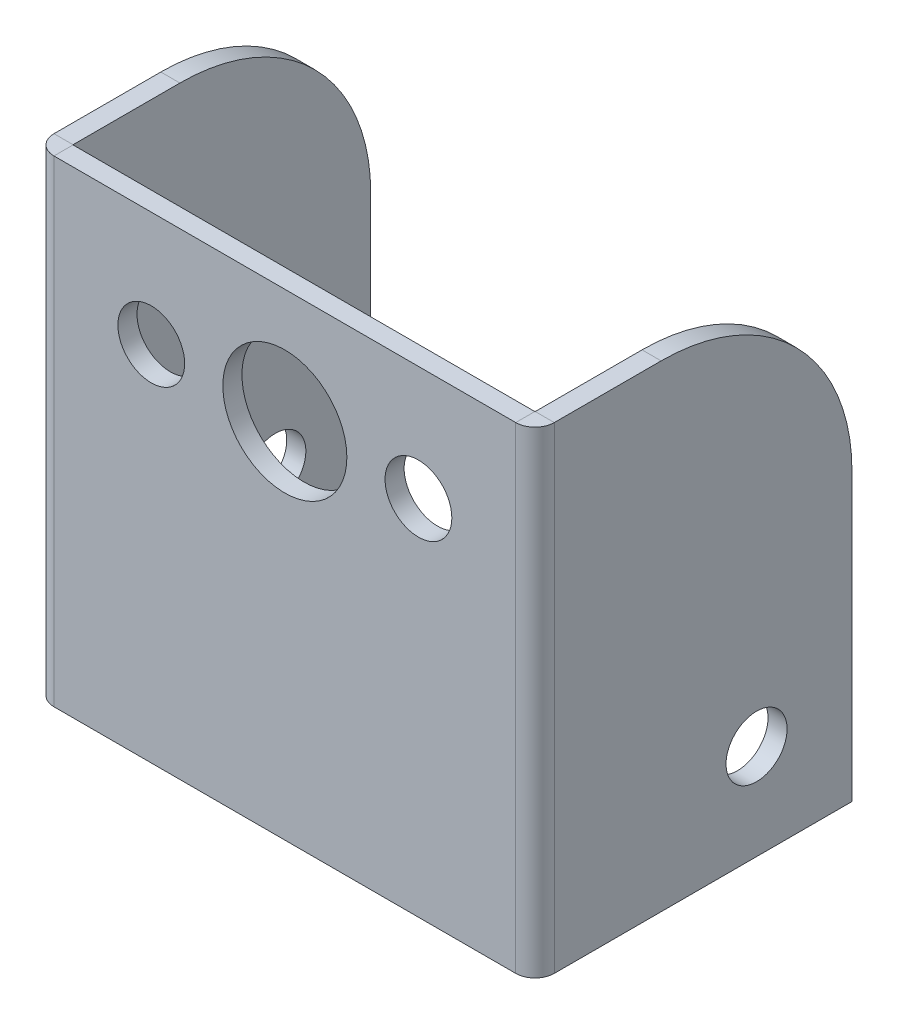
ISO-10303-21;
HEADER;
FILE_DESCRIPTION(('STEP AP214'),'2;1');
FILE_NAME('part.step','',(''),(''),'','','');
FILE_SCHEMA(('AUTOMOTIVE_DESIGN { 1 0 10303 214 1 1 1 1 }'));
ENDSEC;
DATA;
#1=APPLICATION_CONTEXT('core data for automotive mechanical design processes');
#2=APPLICATION_PROTOCOL_DEFINITION('international standard','automotive_design',2000,#1);
#3=PRODUCT_CONTEXT('',#1,'mechanical');
#4=PRODUCT('Part','Part','',(#3));
#5=PRODUCT_RELATED_PRODUCT_CATEGORY('part','',(#4));
#6=PRODUCT_DEFINITION_FORMATION('','',#4);
#7=PRODUCT_DEFINITION_CONTEXT('part definition',#1,'design');
#8=PRODUCT_DEFINITION('design','',#6,#7);
#9=PRODUCT_DEFINITION_SHAPE('','',#8);
#10=(LENGTH_UNIT() NAMED_UNIT(*) SI_UNIT(.MILLI.,.METRE.));
#11=(NAMED_UNIT(*) PLANE_ANGLE_UNIT() SI_UNIT($,.RADIAN.));
#12=(NAMED_UNIT(*) SI_UNIT($,.STERADIAN.) SOLID_ANGLE_UNIT());
#13=UNCERTAINTY_MEASURE_WITH_UNIT(LENGTH_MEASURE(1.E-05),#10,'distance_accuracy_value','');
#14=(GEOMETRIC_REPRESENTATION_CONTEXT(3) GLOBAL_UNCERTAINTY_ASSIGNED_CONTEXT((#13)) GLOBAL_UNIT_ASSIGNED_CONTEXT((#10,
#11,#12)) REPRESENTATION_CONTEXT('',''));
#15=CARTESIAN_POINT('',(0.,0.,0.));
#16=DIRECTION('',(0.,0.,1.));
#17=DIRECTION('',(1.,0.,0.));
#18=AXIS2_PLACEMENT_3D('',#15,#16,#17);
#19=CARTESIAN_POINT('',(0.,25.,1.));
#20=DIRECTION('',(0.,-1.,0.));
#21=DIRECTION('',(0.,0.,-1.));
#22=AXIS2_PLACEMENT_3D('',#19,#20,#21);
#23=PLANE('',#22);
#24=DIRECTION('',(-1.,0.,0.));
#25=VECTOR('',#24,1.);
#26=CARTESIAN_POINT('',(0.,25.,0.));
#27=LINE('',#26,#25);
#28=CARTESIAN_POINT('',(40.5994469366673,25.,0.));
#29=VERTEX_POINT('',#28);
#30=CARTESIAN_POINT('',(16.4005530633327,25.,-1.14802731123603E-08));
#31=VERTEX_POINT('',#30);
#32=EDGE_CURVE('E290',#29,#31,#27,.T.);
#33=ORIENTED_EDGE('',*,*,#32,.T.);
#34=DIRECTION('',(0.,0.,1.));
#35=VECTOR('',#34,1.);
#36=CARTESIAN_POINT('',(16.4005530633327,25.,1.));
#37=LINE('',#36,#35);
#38=CARTESIAN_POINT('',(16.4005530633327,25.,0.999999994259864));
#39=VERTEX_POINT('',#38);
#40=EDGE_CURVE('E280',#31,#39,#37,.T.);
#41=ORIENTED_EDGE('',*,*,#40,.T.);
#42=DIRECTION('',(-1.,0.,0.));
#43=VECTOR('',#42,1.);
#44=CARTESIAN_POINT('',(0.,25.,1.));
#45=LINE('',#44,#43);
#46=CARTESIAN_POINT('',(40.5994469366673,25.,1.00000001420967));
#47=VERTEX_POINT('',#46);
#48=EDGE_CURVE('E268',#47,#39,#45,.T.);
#49=ORIENTED_EDGE('',*,*,#48,.F.);
#50=DIRECTION('',(0.,0.,1.));
#51=VECTOR('',#50,1.);
#52=CARTESIAN_POINT('',(40.5994469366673,25.,1.));
#53=LINE('',#52,#51);
#54=EDGE_CURVE('E274',#29,#47,#53,.T.);
#55=ORIENTED_EDGE('',*,*,#54,.F.);
#56=EDGE_LOOP('',(#33,#41,#49,#55));
#57=FACE_BOUND('',#56,.T.);
#58=ADVANCED_FACE('F40',(#57),#23,.F.);
#59=CARTESIAN_POINT('',(0.,0.,1.));
#60=DIRECTION('',(0.,1.,0.));
#61=DIRECTION('',(0.,0.,1.));
#62=AXIS2_PLACEMENT_3D('',#59,#60,#61);
#63=PLANE('',#62);
#64=DIRECTION('',(1.,0.,0.));
#65=VECTOR('',#64,1.);
#66=CARTESIAN_POINT('',(0.,0.,1.));
#67=LINE('',#66,#65);
#68=CARTESIAN_POINT('',(16.4005530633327,0.,0.999999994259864));
#69=VERTEX_POINT('',#68);
#70=CARTESIAN_POINT('',(40.5994469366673,0.,1.));
#71=VERTEX_POINT('',#70);
#72=EDGE_CURVE('E293',#69,#71,#67,.T.);
#73=ORIENTED_EDGE('',*,*,#72,.F.);
#74=DIRECTION('',(0.,0.,-1.));
#75=VECTOR('',#74,1.);
#76=CARTESIAN_POINT('',(16.4005530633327,0.,1.));
#77=LINE('',#76,#75);
#78=CARTESIAN_POINT('',(16.4005530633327,0.,0.));
#79=VERTEX_POINT('',#78);
#80=EDGE_CURVE('E285',#69,#79,#77,.T.);
#81=ORIENTED_EDGE('',*,*,#80,.T.);
#82=DIRECTION('',(1.,0.,0.));
#83=VECTOR('',#82,1.);
#84=CARTESIAN_POINT('',(0.,0.,0.));
#85=LINE('',#84,#83);
#86=CARTESIAN_POINT('',(40.5994469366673,0.,0.));
#87=VERTEX_POINT('',#86);
#88=EDGE_CURVE('E263',#79,#87,#85,.T.);
#89=ORIENTED_EDGE('',*,*,#88,.T.);
#90=DIRECTION('',(0.,0.,-1.));
#91=VECTOR('',#90,1.);
#92=CARTESIAN_POINT('',(40.5994469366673,0.,1.));
#93=LINE('',#92,#91);
#94=EDGE_CURVE('E267',#71,#87,#93,.T.);
#95=ORIENTED_EDGE('',*,*,#94,.F.);
#96=EDGE_LOOP('',(#73,#81,#89,#95));
#97=FACE_BOUND('',#96,.T.);
#98=ADVANCED_FACE('F42',(#97),#63,.F.);
#99=CARTESIAN_POINT('',(0.,25.,1.));
#100=DIRECTION('',(0.,0.,-1.));
#101=DIRECTION('',(-1.,0.,0.));
#102=AXIS2_PLACEMENT_3D('',#99,#100,#101);
#103=PLANE('',#102);
#104=CARTESIAN_POINT('',(35.5,19.,1.));
#105=DIRECTION('',(0.,0.,1.));
#106=DIRECTION('',(1.,0.,0.));
#107=AXIS2_PLACEMENT_3D('',#104,#105,#106);
#108=CIRCLE('',#107,1.75);
#109=CARTESIAN_POINT('',(37.25,19.,1.));
#110=VERTEX_POINT('',#109);
#111=EDGE_CURVE('E248',#110,#110,#108,.T.);
#112=ORIENTED_EDGE('',*,*,#111,.F.);
#113=EDGE_LOOP('',(#112));
#114=FACE_BOUND('',#113,.T.);
#115=CARTESIAN_POINT('',(28.5,19.,1.));
#116=DIRECTION('',(0.,0.,1.));
#117=DIRECTION('',(1.,0.,0.));
#118=AXIS2_PLACEMENT_3D('',#115,#116,#117);
#119=CIRCLE('',#118,3.25);
#120=CARTESIAN_POINT('',(31.75,19.,1.));
#121=VERTEX_POINT('',#120);
#122=EDGE_CURVE('E260',#121,#121,#119,.T.);
#123=ORIENTED_EDGE('',*,*,#122,.F.);
#124=EDGE_LOOP('',(#123));
#125=FACE_BOUND('',#124,.T.);
#126=CARTESIAN_POINT('',(21.5,19.,1.));
#127=DIRECTION('',(0.,0.,1.));
#128=DIRECTION('',(1.,0.,0.));
#129=AXIS2_PLACEMENT_3D('',#126,#127,#128);
#130=CIRCLE('',#129,1.75);
#131=CARTESIAN_POINT('',(23.25,19.,1.));
#132=VERTEX_POINT('',#131);
#133=EDGE_CURVE('E254',#132,#132,#130,.T.);
#134=ORIENTED_EDGE('',*,*,#133,.F.);
#135=EDGE_LOOP('',(#134));
#136=FACE_BOUND('',#135,.T.);
#137=ORIENTED_EDGE('',*,*,#48,.T.);
#138=DIRECTION('',(0.,-1.,0.));
#139=VECTOR('',#138,1.);
#140=CARTESIAN_POINT('',(16.4005530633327,25.,1.));
#141=LINE('',#140,#139);
#142=EDGE_CURVE('E277',#39,#69,#141,.T.);
#143=ORIENTED_EDGE('',*,*,#142,.T.);
#144=ORIENTED_EDGE('',*,*,#72,.T.);
#145=DIRECTION('',(0.,-1.,0.));
#146=VECTOR('',#145,1.);
#147=CARTESIAN_POINT('',(40.5994469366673,25.,1.));
#148=LINE('',#147,#146);
#149=EDGE_CURVE('E264',#47,#71,#148,.T.);
#150=ORIENTED_EDGE('',*,*,#149,.F.);
#151=EDGE_LOOP('',(#137,#143,#144,#150));
#152=FACE_BOUND('',#151,.T.);
#153=ADVANCED_FACE('F332',(#114,#125,#136,#152),#103,.F.);
#154=CARTESIAN_POINT('',(0.,25.,0.));
#155=DIRECTION('',(0.,0.,-1.));
#156=DIRECTION('',(-1.,0.,0.));
#157=AXIS2_PLACEMENT_3D('',#154,#155,#156);
#158=PLANE('',#157);
#159=DIRECTION('',(0.,-1.,0.));
#160=VECTOR('',#159,1.);
#161=CARTESIAN_POINT('',(16.4005530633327,25.,0.));
#162=LINE('',#161,#160);
#163=EDGE_CURVE('E283',#31,#79,#162,.T.);
#164=ORIENTED_EDGE('',*,*,#163,.F.);
#165=ORIENTED_EDGE('',*,*,#32,.F.);
#166=DIRECTION('',(0.,-1.,0.));
#167=VECTOR('',#166,1.);
#168=CARTESIAN_POINT('',(40.5994469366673,25.,0.));
#169=LINE('',#168,#167);
#170=EDGE_CURVE('E271',#29,#87,#169,.T.);
#171=ORIENTED_EDGE('',*,*,#170,.T.);
#172=ORIENTED_EDGE('',*,*,#88,.F.);
#173=EDGE_LOOP('',(#164,#165,#171,#172));
#174=FACE_BOUND('',#173,.T.);
#175=CARTESIAN_POINT('',(21.5,19.,0.));
#176=DIRECTION('',(0.,0.,1.));
#177=DIRECTION('',(1.,0.,0.));
#178=AXIS2_PLACEMENT_3D('',#175,#176,#177);
#179=CIRCLE('',#178,1.75);
#180=CARTESIAN_POINT('',(23.25,19.,0.));
#181=VERTEX_POINT('',#180);
#182=EDGE_CURVE('E251',#181,#181,#179,.T.);
#183=ORIENTED_EDGE('',*,*,#182,.T.);
#184=EDGE_LOOP('',(#183));
#185=FACE_BOUND('',#184,.T.);
#186=CARTESIAN_POINT('',(28.5,19.,0.));
#187=DIRECTION('',(0.,0.,1.));
#188=DIRECTION('',(1.,0.,0.));
#189=AXIS2_PLACEMENT_3D('',#186,#187,#188);
#190=CIRCLE('',#189,3.25);
#191=CARTESIAN_POINT('',(31.75,19.,0.));
#192=VERTEX_POINT('',#191);
#193=EDGE_CURVE('E257',#192,#192,#190,.T.);
#194=ORIENTED_EDGE('',*,*,#193,.T.);
#195=EDGE_LOOP('',(#194));
#196=FACE_BOUND('',#195,.T.);
#197=CARTESIAN_POINT('',(35.5,19.,0.));
#198=DIRECTION('',(0.,0.,1.));
#199=DIRECTION('',(1.,0.,0.));
#200=AXIS2_PLACEMENT_3D('',#197,#198,#199);
#201=CIRCLE('',#200,1.75);
#202=CARTESIAN_POINT('',(37.25,19.,0.));
#203=VERTEX_POINT('',#202);
#204=EDGE_CURVE('E245',#203,#203,#201,.T.);
#205=ORIENTED_EDGE('',*,*,#204,.T.);
#206=EDGE_LOOP('',(#205));
#207=FACE_BOUND('',#206,.T.);
#208=ADVANCED_FACE('F321',(#174,#185,#196,#207),#158,.T.);
#209=CARTESIAN_POINT('',(28.5,19.,1.));
#210=DIRECTION('',(0.,0.,-1.));
#211=DIRECTION('',(-1.,0.,0.));
#212=AXIS2_PLACEMENT_3D('',#209,#210,#211);
#213=CYLINDRICAL_SURFACE('',#212,3.25);
#214=ORIENTED_EDGE('',*,*,#122,.T.);
#215=EDGE_LOOP('',(#214));
#216=FACE_BOUND('',#215,.T.);
#217=ORIENTED_EDGE('',*,*,#193,.F.);
#218=EDGE_LOOP('',(#217));
#219=FACE_BOUND('',#218,.T.);
#220=ADVANCED_FACE('F355',(#216,#219),#213,.F.);
#221=CARTESIAN_POINT('',(21.5,19.,1.));
#222=DIRECTION('',(0.,0.,-1.));
#223=DIRECTION('',(-1.,0.,0.));
#224=AXIS2_PLACEMENT_3D('',#221,#222,#223);
#225=CYLINDRICAL_SURFACE('',#224,1.75);
#226=ORIENTED_EDGE('',*,*,#133,.T.);
#227=EDGE_LOOP('',(#226));
#228=FACE_BOUND('',#227,.T.);
#229=ORIENTED_EDGE('',*,*,#182,.F.);
#230=EDGE_LOOP('',(#229));
#231=FACE_BOUND('',#230,.T.);
#232=ADVANCED_FACE('F360',(#228,#231),#225,.F.);
#233=CARTESIAN_POINT('',(35.5,19.,1.));
#234=DIRECTION('',(0.,0.,-1.));
#235=DIRECTION('',(-1.,0.,0.));
#236=AXIS2_PLACEMENT_3D('',#233,#234,#235);
#237=CYLINDRICAL_SURFACE('',#236,1.75);
#238=ORIENTED_EDGE('',*,*,#111,.T.);
#239=EDGE_LOOP('',(#238));
#240=FACE_BOUND('',#239,.T.);
#241=ORIENTED_EDGE('',*,*,#204,.F.);
#242=EDGE_LOOP('',(#241));
#243=FACE_BOUND('',#242,.T.);
#244=ADVANCED_FACE('F373',(#240,#243),#237,.F.);
#245=CARTESIAN_POINT('',(40.5994469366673,25.,-0.0100000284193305));
#246=DIRECTION('',(0.,1.,0.));
#247=DIRECTION('',(0.,0.,1.));
#248=AXIS2_PLACEMENT_3D('',#245,#246,#247);
#249=PLANE('',#248);
#250=DIRECTION('',(1.,0.,0.));
#251=VECTOR('',#250,1.);
#252=CARTESIAN_POINT('',(41.6094469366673,25.,-0.0100000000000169));
#253=LINE('',#252,#251);
#254=CARTESIAN_POINT('',(40.6094469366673,25.,-0.00999999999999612));
#255=VERTEX_POINT('',#254);
#256=CARTESIAN_POINT('',(41.6094469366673,25.,-0.0100000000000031));
#257=VERTEX_POINT('',#256);
#258=EDGE_CURVE('E199',#255,#257,#253,.T.);
#259=ORIENTED_EDGE('',*,*,#258,.F.);
#260=CARTESIAN_POINT('',(40.5994469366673,25.,-0.01));
#261=DIRECTION('',(0.,1.,0.));
#262=DIRECTION('',(0.,0.,1.));
#263=AXIS2_PLACEMENT_3D('',#260,#261,#262);
#264=CIRCLE('',#263,0.0100000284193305);
#265=EDGE_CURVE('E202',#255,#29,#264,.F.);
#266=ORIENTED_EDGE('',*,*,#265,.T.);
#267=ORIENTED_EDGE('',*,*,#54,.T.);
#268=CARTESIAN_POINT('',(40.5994469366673,25.,-0.0100000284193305));
#269=DIRECTION('',(0.,-1.,0.));
#270=DIRECTION('',(0.,0.,-1.));
#271=AXIS2_PLACEMENT_3D('',#268,#269,#270);
#272=CIRCLE('',#271,1.010000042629);
#273=EDGE_CURVE('E237',#257,#47,#272,.T.);
#274=ORIENTED_EDGE('',*,*,#273,.F.);
#275=EDGE_LOOP('',(#259,#266,#267,#274));
#276=FACE_BOUND('',#275,.T.);
#277=ADVANCED_FACE('F382',(#276),#249,.T.);
#278=CARTESIAN_POINT('',(40.5994469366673,0.,-0.0100000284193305));
#279=DIRECTION('',(0.,-1.,0.));
#280=DIRECTION('',(0.,0.,-1.));
#281=AXIS2_PLACEMENT_3D('',#278,#279,#280);
#282=PLANE('',#281);
#283=ORIENTED_EDGE('',*,*,#94,.T.);
#284=CARTESIAN_POINT('',(40.5994469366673,0.,-0.01));
#285=DIRECTION('',(0.,1.,0.));
#286=DIRECTION('',(0.,0.,1.));
#287=AXIS2_PLACEMENT_3D('',#284,#285,#286);
#288=CIRCLE('',#287,0.0100000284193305);
#289=CARTESIAN_POINT('',(40.6094469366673,0.,-0.00999999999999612));
#290=VERTEX_POINT('',#289);
#291=EDGE_CURVE('E234',#87,#290,#288,.T.);
#292=ORIENTED_EDGE('',*,*,#291,.T.);
#293=DIRECTION('',(-1.,0.,0.));
#294=VECTOR('',#293,1.);
#295=CARTESIAN_POINT('',(41.6094469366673,0.,-0.0100000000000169));
#296=LINE('',#295,#294);
#297=CARTESIAN_POINT('',(41.6094469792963,0.,-0.0099999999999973));
#298=VERTEX_POINT('',#297);
#299=EDGE_CURVE('E210',#298,#290,#296,.T.);
#300=ORIENTED_EDGE('',*,*,#299,.F.);
#301=CARTESIAN_POINT('',(40.5994469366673,0.,-0.0100000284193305));
#302=DIRECTION('',(0.,1.,0.));
#303=DIRECTION('',(0.,0.,1.));
#304=AXIS2_PLACEMENT_3D('',#301,#302,#303);
#305=CIRCLE('',#304,1.010000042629);
#306=EDGE_CURVE('E242',#71,#298,#305,.T.);
#307=ORIENTED_EDGE('',*,*,#306,.F.);
#308=EDGE_LOOP('',(#283,#292,#300,#307));
#309=FACE_BOUND('',#308,.T.);
#310=ADVANCED_FACE('F388',(#309),#282,.T.);
#311=CARTESIAN_POINT('',(40.5994469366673,-12.532813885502,-0.01));
#312=DIRECTION('',(0.,1.,0.));
#313=DIRECTION('',(0.,0.,1.));
#314=AXIS2_PLACEMENT_3D('',#311,#312,#313);
#315=CYLINDRICAL_SURFACE('',#314,1.01000002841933);
#316=ORIENTED_EDGE('',*,*,#306,.T.);
#317=DIRECTION('',(0.,-1.,0.));
#318=VECTOR('',#317,1.);
#319=CARTESIAN_POINT('',(41.6094469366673,25.,-0.0100000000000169));
#320=LINE('',#319,#318);
#321=EDGE_CURVE('E218',#257,#298,#320,.T.);
#322=ORIENTED_EDGE('',*,*,#321,.F.);
#323=ORIENTED_EDGE('',*,*,#273,.T.);
#324=ORIENTED_EDGE('',*,*,#149,.T.);
#325=EDGE_LOOP('',(#316,#322,#323,#324));
#326=FACE_BOUND('',#325,.T.);
#327=ADVANCED_FACE('F394',(#326),#315,.T.);
#328=CARTESIAN_POINT('',(40.5994469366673,-12.532813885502,-0.01));
#329=DIRECTION('',(0.,1.,0.));
#330=DIRECTION('',(0.,0.,1.));
#331=AXIS2_PLACEMENT_3D('',#328,#329,#330);
#332=CYLINDRICAL_SURFACE('',#331,0.0100000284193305);
#333=ORIENTED_EDGE('',*,*,#291,.F.);
#334=ORIENTED_EDGE('',*,*,#170,.F.);
#335=ORIENTED_EDGE('',*,*,#265,.F.);
#336=DIRECTION('',(0.,-1.,0.));
#337=VECTOR('',#336,1.);
#338=CARTESIAN_POINT('',(40.6094469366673,25.,-0.01000000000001));
#339=LINE('',#338,#337);
#340=EDGE_CURVE('E198',#255,#290,#339,.T.);
#341=ORIENTED_EDGE('',*,*,#340,.T.);
#342=EDGE_LOOP('',(#333,#334,#335,#341));
#343=FACE_BOUND('',#342,.T.);
#344=ADVANCED_FACE('F398',(#343),#332,.F.);
#345=CARTESIAN_POINT('',(41.6094469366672,0.,-15.6094469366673));
#346=DIRECTION('',(0.,0.,1.));
#347=DIRECTION('',(1.,0.,0.));
#348=AXIS2_PLACEMENT_3D('',#345,#346,#347);
#349=PLANE('',#348);
#350=DIRECTION('',(0.,1.,0.));
#351=VECTOR('',#350,1.);
#352=CARTESIAN_POINT('',(40.6094469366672,0.,-15.6094469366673));
#353=LINE('',#352,#351);
#354=CARTESIAN_POINT('',(40.6094469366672,0.,-15.6094469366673));
#355=VERTEX_POINT('',#354);
#356=CARTESIAN_POINT('',(40.6094469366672,15.,-15.6094469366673));
#357=VERTEX_POINT('',#356);
#358=EDGE_CURVE('E229',#355,#357,#353,.T.);
#359=ORIENTED_EDGE('',*,*,#358,.T.);
#360=DIRECTION('',(-1.,0.,0.));
#361=VECTOR('',#360,1.);
#362=CARTESIAN_POINT('',(41.6094469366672,15.,-15.6094469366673));
#363=LINE('',#362,#361);
#364=CARTESIAN_POINT('',(41.6094469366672,15.,-15.6094469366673));
#365=VERTEX_POINT('',#364);
#366=EDGE_CURVE('E301',#357,#365,#363,.F.);
#367=ORIENTED_EDGE('',*,*,#366,.T.);
#368=DIRECTION('',(0.,1.,0.));
#369=VECTOR('',#368,1.);
#370=CARTESIAN_POINT('',(41.6094469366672,0.,-15.6094469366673));
#371=LINE('',#370,#369);
#372=CARTESIAN_POINT('',(41.6094469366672,0.,-15.6094469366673));
#373=VERTEX_POINT('',#372);
#374=EDGE_CURVE('E213',#373,#365,#371,.T.);
#375=ORIENTED_EDGE('',*,*,#374,.F.);
#376=DIRECTION('',(-1.,0.,0.));
#377=VECTOR('',#376,1.);
#378=CARTESIAN_POINT('',(41.6094469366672,0.,-15.6094469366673));
#379=LINE('',#378,#377);
#380=EDGE_CURVE('E226',#373,#355,#379,.T.);
#381=ORIENTED_EDGE('',*,*,#380,.T.);
#382=EDGE_LOOP('',(#359,#367,#375,#381));
#383=FACE_BOUND('',#382,.T.);
#384=ADVANCED_FACE('F402',(#383),#349,.F.);
#385=CARTESIAN_POINT('',(41.6094469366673,5.,-10.6094469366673));
#386=DIRECTION('',(-1.,0.,0.));
#387=DIRECTION('',(0.,0.,1.));
#388=AXIS2_PLACEMENT_3D('',#385,#386,#387);
#389=CYLINDRICAL_SURFACE('',#388,1.6);
#390=CARTESIAN_POINT('',(41.6094469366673,5.,-10.6094469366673));
#391=DIRECTION('',(1.,0.,0.));
#392=DIRECTION('',(0.,0.,-1.));
#393=AXIS2_PLACEMENT_3D('',#390,#391,#392);
#394=CIRCLE('',#393,1.6);
#395=CARTESIAN_POINT('',(41.6094469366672,5.,-12.2094469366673));
#396=VERTEX_POINT('',#395);
#397=EDGE_CURVE('E223',#396,#396,#394,.T.);
#398=ORIENTED_EDGE('',*,*,#397,.T.);
#399=EDGE_LOOP('',(#398));
#400=FACE_BOUND('',#399,.T.);
#401=CARTESIAN_POINT('',(40.6094469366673,5.,-10.6094469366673));
#402=DIRECTION('',(1.,0.,0.));
#403=DIRECTION('',(0.,0.,-1.));
#404=AXIS2_PLACEMENT_3D('',#401,#402,#403);
#405=CIRCLE('',#404,1.6);
#406=CARTESIAN_POINT('',(40.6094469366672,5.,-12.2094469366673));
#407=VERTEX_POINT('',#406);
#408=EDGE_CURVE('E205',#407,#407,#405,.T.);
#409=ORIENTED_EDGE('',*,*,#408,.F.);
#410=EDGE_LOOP('',(#409));
#411=FACE_BOUND('',#410,.T.);
#412=ADVANCED_FACE('F419',(#400,#411),#389,.F.);
#413=CARTESIAN_POINT('',(41.6094469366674,25.,41.3905530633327));
#414=DIRECTION('',(-1.,0.,0.));
#415=DIRECTION('',(0.,0.,1.));
#416=AXIS2_PLACEMENT_3D('',#413,#414,#415);
#417=PLANE('',#416);
#418=ORIENTED_EDGE('',*,*,#397,.F.);
#419=EDGE_LOOP('',(#418));
#420=FACE_BOUND('',#419,.T.);
#421=ORIENTED_EDGE('',*,*,#374,.T.);
#422=CARTESIAN_POINT('',(41.6094469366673,15.,-5.60944693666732));
#423=DIRECTION('',(-1.,0.,0.));
#424=DIRECTION('',(0.,0.,1.));
#425=AXIS2_PLACEMENT_3D('',#422,#423,#424);
#426=CIRCLE('',#425,10.);
#427=CARTESIAN_POINT('',(41.6094469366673,25.,-5.6094469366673));
#428=VERTEX_POINT('',#427);
#429=EDGE_CURVE('E303',#365,#428,#426,.F.);
#430=ORIENTED_EDGE('',*,*,#429,.T.);
#431=DIRECTION('',(0.,0.,1.));
#432=VECTOR('',#431,1.);
#433=CARTESIAN_POINT('',(41.6094469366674,25.,41.3905530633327));
#434=LINE('',#433,#432);
#435=EDGE_CURVE('E221',#428,#257,#434,.T.);
#436=ORIENTED_EDGE('',*,*,#435,.T.);
#437=ORIENTED_EDGE('',*,*,#321,.T.);
#438=DIRECTION('',(0.,0.,-1.));
#439=VECTOR('',#438,1.);
#440=CARTESIAN_POINT('',(41.6094469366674,0.,41.3905530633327));
#441=LINE('',#440,#439);
#442=EDGE_CURVE('E216',#298,#373,#441,.T.);
#443=ORIENTED_EDGE('',*,*,#442,.T.);
#444=EDGE_LOOP('',(#421,#430,#436,#437,#443));
#445=FACE_BOUND('',#444,.T.);
#446=ADVANCED_FACE('F415',(#420,#445),#417,.F.);
#447=CARTESIAN_POINT('',(41.6094469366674,0.,41.3905530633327));
#448=DIRECTION('',(0.,1.,0.));
#449=DIRECTION('',(1.,0.,0.));
#450=AXIS2_PLACEMENT_3D('',#447,#448,#449);
#451=PLANE('',#450);
#452=ORIENTED_EDGE('',*,*,#442,.F.);
#453=ORIENTED_EDGE('',*,*,#299,.T.);
#454=DIRECTION('',(0.,0.,-1.));
#455=VECTOR('',#454,1.);
#456=CARTESIAN_POINT('',(40.6094469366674,0.,41.3905530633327));
#457=LINE('',#456,#455);
#458=EDGE_CURVE('E208',#290,#355,#457,.T.);
#459=ORIENTED_EDGE('',*,*,#458,.T.);
#460=ORIENTED_EDGE('',*,*,#380,.F.);
#461=EDGE_LOOP('',(#452,#453,#459,#460));
#462=FACE_BOUND('',#461,.T.);
#463=ADVANCED_FACE('F411',(#462),#451,.F.);
#464=CARTESIAN_POINT('',(40.6094469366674,25.,41.3905530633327));
#465=DIRECTION('',(-1.,0.,0.));
#466=DIRECTION('',(0.,0.,1.));
#467=AXIS2_PLACEMENT_3D('',#464,#465,#466);
#468=PLANE('',#467);
#469=DIRECTION('',(0.,0.,1.));
#470=VECTOR('',#469,1.);
#471=CARTESIAN_POINT('',(40.6094469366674,25.,41.3905530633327));
#472=LINE('',#471,#470);
#473=CARTESIAN_POINT('',(40.6094469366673,25.,-5.6094469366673));
#474=VERTEX_POINT('',#473);
#475=EDGE_CURVE('E203',#474,#255,#472,.T.);
#476=ORIENTED_EDGE('',*,*,#475,.F.);
#477=CARTESIAN_POINT('',(40.6094469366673,15.,-5.60944693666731));
#478=DIRECTION('',(-1.,0.,0.));
#479=DIRECTION('',(0.,0.,1.));
#480=AXIS2_PLACEMENT_3D('',#477,#478,#479);
#481=CIRCLE('',#480,10.);
#482=EDGE_CURVE('E299',#474,#357,#481,.T.);
#483=ORIENTED_EDGE('',*,*,#482,.T.);
#484=ORIENTED_EDGE('',*,*,#358,.F.);
#485=ORIENTED_EDGE('',*,*,#458,.F.);
#486=ORIENTED_EDGE('',*,*,#340,.F.);
#487=EDGE_LOOP('',(#476,#483,#484,#485,#486));
#488=FACE_BOUND('',#487,.T.);
#489=ORIENTED_EDGE('',*,*,#408,.T.);
#490=EDGE_LOOP('',(#489));
#491=FACE_BOUND('',#490,.T.);
#492=ADVANCED_FACE('F407',(#488,#491),#468,.T.);
#493=CARTESIAN_POINT('',(41.6094469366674,25.,41.3905530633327));
#494=DIRECTION('',(0.,-1.,0.));
#495=DIRECTION('',(-1.,0.,0.));
#496=AXIS2_PLACEMENT_3D('',#493,#494,#495);
#497=PLANE('',#496);
#498=ORIENTED_EDGE('',*,*,#435,.F.);
#499=DIRECTION('',(-1.,0.,0.));
#500=VECTOR('',#499,1.);
#501=CARTESIAN_POINT('',(41.6094469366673,25.,-5.60944693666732));
#502=LINE('',#501,#500);
#503=EDGE_CURVE('E288',#428,#474,#502,.T.);
#504=ORIENTED_EDGE('',*,*,#503,.T.);
#505=ORIENTED_EDGE('',*,*,#475,.T.);
#506=ORIENTED_EDGE('',*,*,#258,.T.);
#507=EDGE_LOOP('',(#498,#504,#505,#506));
#508=FACE_BOUND('',#507,.T.);
#509=ADVANCED_FACE('F404',(#508),#497,.F.);
#510=CARTESIAN_POINT('',(16.4005530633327,25.,-0.00999998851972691));
#511=DIRECTION('',(0.,1.,0.));
#512=DIRECTION('',(0.,0.,1.));
#513=AXIS2_PLACEMENT_3D('',#510,#511,#512);
#514=PLANE('',#513);
#515=ORIENTED_EDGE('',*,*,#40,.F.);
#516=CARTESIAN_POINT('',(16.4005530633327,25.,-0.01));
#517=DIRECTION('',(0.,-1.,0.));
#518=DIRECTION('',(0.,0.,-1.));
#519=AXIS2_PLACEMENT_3D('',#516,#517,#518);
#520=CIRCLE('',#519,0.00999998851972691);
#521=CARTESIAN_POINT('',(16.3905530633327,25.,-0.00999999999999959));
#522=VERTEX_POINT('',#521);
#523=EDGE_CURVE('E167',#31,#522,#520,.T.);
#524=ORIENTED_EDGE('',*,*,#523,.T.);
#525=DIRECTION('',(-1.,0.,0.));
#526=VECTOR('',#525,1.);
#527=CARTESIAN_POINT('',(15.3905530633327,25.,-0.00999999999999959));
#528=LINE('',#527,#526);
#529=CARTESIAN_POINT('',(15.3905530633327,25.,-0.0100000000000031));
#530=VERTEX_POINT('',#529);
#531=EDGE_CURVE('E181',#522,#530,#528,.T.);
#532=ORIENTED_EDGE('',*,*,#531,.T.);
#533=CARTESIAN_POINT('',(16.4005530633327,25.,-0.00999998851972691));
#534=DIRECTION('',(0.,-1.,0.));
#535=DIRECTION('',(0.,0.,-1.));
#536=AXIS2_PLACEMENT_3D('',#533,#534,#535);
#537=CIRCLE('',#536,1.00999998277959);
#538=EDGE_CURVE('E190',#39,#530,#537,.T.);
#539=ORIENTED_EDGE('',*,*,#538,.F.);
#540=EDGE_LOOP('',(#515,#524,#532,#539));
#541=FACE_BOUND('',#540,.T.);
#542=ADVANCED_FACE('F336',(#541),#514,.T.);
#543=CARTESIAN_POINT('',(16.4005530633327,0.,-0.00999998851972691));
#544=DIRECTION('',(0.,-1.,0.));
#545=DIRECTION('',(0.,0.,-1.));
#546=AXIS2_PLACEMENT_3D('',#543,#544,#545);
#547=PLANE('',#546);
#548=DIRECTION('',(1.,0.,0.));
#549=VECTOR('',#548,1.);
#550=CARTESIAN_POINT('',(15.3905530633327,0.,-0.00999999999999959));
#551=LINE('',#550,#549);
#552=CARTESIAN_POINT('',(15.390553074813,0.,-0.00999999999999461));
#553=VERTEX_POINT('',#552);
#554=CARTESIAN_POINT('',(16.3905530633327,0.,-0.00999999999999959));
#555=VERTEX_POINT('',#554);
#556=EDGE_CURVE('E158',#553,#555,#551,.T.);
#557=ORIENTED_EDGE('',*,*,#556,.T.);
#558=CARTESIAN_POINT('',(16.4005530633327,0.,-0.01));
#559=DIRECTION('',(0.,-1.,0.));
#560=DIRECTION('',(0.,0.,-1.));
#561=AXIS2_PLACEMENT_3D('',#558,#559,#560);
#562=CIRCLE('',#561,0.00999998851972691);
#563=EDGE_CURVE('E187',#555,#79,#562,.F.);
#564=ORIENTED_EDGE('',*,*,#563,.T.);
#565=ORIENTED_EDGE('',*,*,#80,.F.);
#566=CARTESIAN_POINT('',(16.4005530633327,0.,-0.00999998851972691));
#567=DIRECTION('',(0.,1.,0.));
#568=DIRECTION('',(0.,0.,1.));
#569=AXIS2_PLACEMENT_3D('',#566,#567,#568);
#570=CIRCLE('',#569,1.00999998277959);
#571=EDGE_CURVE('E195',#553,#69,#570,.T.);
#572=ORIENTED_EDGE('',*,*,#571,.F.);
#573=EDGE_LOOP('',(#557,#564,#565,#572));
#574=FACE_BOUND('',#573,.T.);
#575=ADVANCED_FACE('F316',(#574),#547,.T.);
#576=CARTESIAN_POINT('',(16.4005530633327,37.532813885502,-0.01));
#577=DIRECTION('',(0.,-1.,0.));
#578=DIRECTION('',(0.,0.,-1.));
#579=AXIS2_PLACEMENT_3D('',#576,#577,#578);
#580=CYLINDRICAL_SURFACE('',#579,1.00999998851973);
#581=ORIENTED_EDGE('',*,*,#571,.T.);
#582=ORIENTED_EDGE('',*,*,#142,.F.);
#583=ORIENTED_EDGE('',*,*,#538,.T.);
#584=DIRECTION('',(0.,-1.,0.));
#585=VECTOR('',#584,1.);
#586=CARTESIAN_POINT('',(15.3905530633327,25.,-0.00999999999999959));
#587=LINE('',#586,#585);
#588=EDGE_CURVE('E185',#530,#553,#587,.T.);
#589=ORIENTED_EDGE('',*,*,#588,.T.);
#590=EDGE_LOOP('',(#581,#582,#583,#589));
#591=FACE_BOUND('',#590,.T.);
#592=ADVANCED_FACE('F330',(#591),#580,.T.);
#593=CARTESIAN_POINT('',(16.4005530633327,37.532813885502,-0.01));
#594=DIRECTION('',(0.,-1.,0.));
#595=DIRECTION('',(0.,0.,-1.));
#596=AXIS2_PLACEMENT_3D('',#593,#594,#595);
#597=CYLINDRICAL_SURFACE('',#596,0.00999998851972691);
#598=ORIENTED_EDGE('',*,*,#563,.F.);
#599=DIRECTION('',(0.,-1.,0.));
#600=VECTOR('',#599,1.);
#601=CARTESIAN_POINT('',(16.3905530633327,25.,-0.00999999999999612));
#602=LINE('',#601,#600);
#603=EDGE_CURVE('E165',#522,#555,#602,.T.);
#604=ORIENTED_EDGE('',*,*,#603,.F.);
#605=ORIENTED_EDGE('',*,*,#523,.F.);
#606=ORIENTED_EDGE('',*,*,#163,.T.);
#607=EDGE_LOOP('',(#598,#604,#605,#606));
#608=FACE_BOUND('',#607,.T.);
#609=ADVANCED_FACE('F318',(#608),#597,.F.);
#610=CARTESIAN_POINT('',(15.3905530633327,5.,-10.6094469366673));
#611=DIRECTION('',(1.,0.,0.));
#612=DIRECTION('',(0.,0.,-1.));
#613=AXIS2_PLACEMENT_3D('',#610,#611,#612);
#614=CYLINDRICAL_SURFACE('',#613,1.6);
#615=CARTESIAN_POINT('',(15.3905530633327,5.,-10.6094469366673));
#616=DIRECTION('',(-1.,0.,0.));
#617=DIRECTION('',(0.,0.,1.));
#618=AXIS2_PLACEMENT_3D('',#615,#616,#617);
#619=CIRCLE('',#618,1.6);
#620=CARTESIAN_POINT('',(15.3905530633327,5.,-9.0094469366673));
#621=VERTEX_POINT('',#620);
#622=EDGE_CURVE('E178',#621,#621,#619,.T.);
#623=ORIENTED_EDGE('',*,*,#622,.T.);
#624=EDGE_LOOP('',(#623));
#625=FACE_BOUND('',#624,.T.);
#626=CARTESIAN_POINT('',(16.3905530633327,5.,-10.6094469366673));
#627=DIRECTION('',(-1.,0.,0.));
#628=DIRECTION('',(0.,0.,1.));
#629=AXIS2_PLACEMENT_3D('',#626,#627,#628);
#630=CIRCLE('',#629,1.6);
#631=CARTESIAN_POINT('',(16.3905530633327,5.,-9.0094469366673));
#632=VERTEX_POINT('',#631);
#633=EDGE_CURVE('E170',#632,#632,#630,.T.);
#634=ORIENTED_EDGE('',*,*,#633,.F.);
#635=EDGE_LOOP('',(#634));
#636=FACE_BOUND('',#635,.T.);
#637=ADVANCED_FACE('F435',(#625,#636),#614,.F.);
#638=CARTESIAN_POINT('',(15.3905530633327,0.,-15.6094469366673));
#639=DIRECTION('',(0.,0.,1.));
#640=DIRECTION('',(1.,0.,0.));
#641=AXIS2_PLACEMENT_3D('',#638,#639,#640);
#642=PLANE('',#641);
#643=DIRECTION('',(0.,-1.,0.));
#644=VECTOR('',#643,1.);
#645=CARTESIAN_POINT('',(15.3905530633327,0.,-15.6094469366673));
#646=LINE('',#645,#644);
#647=CARTESIAN_POINT('',(15.3905530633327,15.,-15.6094469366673));
#648=VERTEX_POINT('',#647);
#649=CARTESIAN_POINT('',(15.3905530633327,0.,-15.6094469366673));
#650=VERTEX_POINT('',#649);
#651=EDGE_CURVE('E140',#648,#650,#646,.T.);
#652=ORIENTED_EDGE('',*,*,#651,.F.);
#653=DIRECTION('',(1.,0.,0.));
#654=VECTOR('',#653,1.);
#655=CARTESIAN_POINT('',(15.3905530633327,15.,-15.6094469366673));
#656=LINE('',#655,#654);
#657=CARTESIAN_POINT('',(16.3905530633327,15.,-15.6094469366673));
#658=VERTEX_POINT('',#657);
#659=EDGE_CURVE('E305',#648,#658,#656,.T.);
#660=ORIENTED_EDGE('',*,*,#659,.T.);
#661=DIRECTION('',(0.,-1.,0.));
#662=VECTOR('',#661,1.);
#663=CARTESIAN_POINT('',(16.3905530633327,0.,-15.6094469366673));
#664=LINE('',#663,#662);
#665=CARTESIAN_POINT('',(16.3905530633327,0.,-15.6094469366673));
#666=VERTEX_POINT('',#665);
#667=EDGE_CURVE('E162',#658,#666,#664,.T.);
#668=ORIENTED_EDGE('',*,*,#667,.T.);
#669=DIRECTION('',(1.,0.,0.));
#670=VECTOR('',#669,1.);
#671=CARTESIAN_POINT('',(15.3905530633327,0.,-15.6094469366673));
#672=LINE('',#671,#670);
#673=EDGE_CURVE('E156',#650,#666,#672,.T.);
#674=ORIENTED_EDGE('',*,*,#673,.F.);
#675=EDGE_LOOP('',(#652,#660,#668,#674));
#676=FACE_BOUND('',#675,.T.);
#677=ADVANCED_FACE('F161',(#676),#642,.F.);
#678=CARTESIAN_POINT('',(15.3905530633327,25.,-15.6094469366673));
#679=DIRECTION('',(1.,0.,0.));
#680=DIRECTION('',(0.,0.,-1.));
#681=AXIS2_PLACEMENT_3D('',#678,#679,#680);
#682=PLANE('',#681);
#683=DIRECTION('',(0.,0.,-1.));
#684=VECTOR('',#683,1.);
#685=CARTESIAN_POINT('',(15.3905530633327,25.,-15.6094469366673));
#686=LINE('',#685,#684);
#687=CARTESIAN_POINT('',(15.3905530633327,25.,-5.6094469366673));
#688=VERTEX_POINT('',#687);
#689=EDGE_CURVE('E151',#530,#688,#686,.T.);
#690=ORIENTED_EDGE('',*,*,#689,.T.);
#691=CARTESIAN_POINT('',(15.3905530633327,15.,-5.6094469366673));
#692=DIRECTION('',(1.,0.,0.));
#693=DIRECTION('',(0.,0.,-1.));
#694=AXIS2_PLACEMENT_3D('',#691,#692,#693);
#695=CIRCLE('',#694,10.);
#696=EDGE_CURVE('E12',#688,#648,#695,.F.);
#697=ORIENTED_EDGE('',*,*,#696,.T.);
#698=ORIENTED_EDGE('',*,*,#651,.T.);
#699=DIRECTION('',(0.,0.,1.));
#700=VECTOR('',#699,1.);
#701=CARTESIAN_POINT('',(15.3905530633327,0.,-15.6094469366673));
#702=LINE('',#701,#700);
#703=EDGE_CURVE('E144',#650,#553,#702,.T.);
#704=ORIENTED_EDGE('',*,*,#703,.T.);
#705=ORIENTED_EDGE('',*,*,#588,.F.);
#706=EDGE_LOOP('',(#690,#697,#698,#704,#705));
#707=FACE_BOUND('',#706,.T.);
#708=ORIENTED_EDGE('',*,*,#622,.F.);
#709=EDGE_LOOP('',(#708));
#710=FACE_BOUND('',#709,.T.);
#711=ADVANCED_FACE('F142',(#707,#710),#682,.F.);
#712=CARTESIAN_POINT('',(15.3905530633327,25.,-15.6094469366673));
#713=DIRECTION('',(0.,-1.,0.));
#714=DIRECTION('',(1.,0.,0.));
#715=AXIS2_PLACEMENT_3D('',#712,#713,#714);
#716=PLANE('',#715);
#717=DIRECTION('',(0.,0.,-1.));
#718=VECTOR('',#717,1.);
#719=CARTESIAN_POINT('',(16.3905530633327,25.,-15.6094469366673));
#720=LINE('',#719,#718);
#721=CARTESIAN_POINT('',(16.3905530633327,25.,-5.6094469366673));
#722=VERTEX_POINT('',#721);
#723=EDGE_CURVE('E159',#522,#722,#720,.T.);
#724=ORIENTED_EDGE('',*,*,#723,.T.);
#725=DIRECTION('',(1.,0.,0.));
#726=VECTOR('',#725,1.);
#727=CARTESIAN_POINT('',(15.3905530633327,25.,-5.6094469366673));
#728=LINE('',#727,#726);
#729=EDGE_CURVE('E48',#722,#688,#728,.F.);
#730=ORIENTED_EDGE('',*,*,#729,.T.);
#731=ORIENTED_EDGE('',*,*,#689,.F.);
#732=ORIENTED_EDGE('',*,*,#531,.F.);
#733=EDGE_LOOP('',(#724,#730,#731,#732));
#734=FACE_BOUND('',#733,.T.);
#735=ADVANCED_FACE('F337',(#734),#716,.F.);
#736=CARTESIAN_POINT('',(16.3905530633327,25.,-15.6094469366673));
#737=DIRECTION('',(1.,0.,0.));
#738=DIRECTION('',(0.,0.,-1.));
#739=AXIS2_PLACEMENT_3D('',#736,#737,#738);
#740=PLANE('',#739);
#741=ORIENTED_EDGE('',*,*,#633,.T.);
#742=EDGE_LOOP('',(#741));
#743=FACE_BOUND('',#742,.T.);
#744=ORIENTED_EDGE('',*,*,#667,.F.);
#745=CARTESIAN_POINT('',(16.3905530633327,15.,-5.6094469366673));
#746=DIRECTION('',(1.,0.,0.));
#747=DIRECTION('',(0.,0.,-1.));
#748=AXIS2_PLACEMENT_3D('',#745,#746,#747);
#749=CIRCLE('',#748,10.);
#750=EDGE_CURVE('E62',#658,#722,#749,.T.);
#751=ORIENTED_EDGE('',*,*,#750,.T.);
#752=ORIENTED_EDGE('',*,*,#723,.F.);
#753=ORIENTED_EDGE('',*,*,#603,.T.);
#754=DIRECTION('',(0.,0.,1.));
#755=VECTOR('',#754,1.);
#756=CARTESIAN_POINT('',(16.3905530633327,0.,-15.6094469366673));
#757=LINE('',#756,#755);
#758=EDGE_CURVE('E164',#666,#555,#757,.T.);
#759=ORIENTED_EDGE('',*,*,#758,.F.);
#760=EDGE_LOOP('',(#744,#751,#752,#753,#759));
#761=FACE_BOUND('',#760,.T.);
#762=ADVANCED_FACE('F308',(#743,#761),#740,.T.);
#763=CARTESIAN_POINT('',(15.3905530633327,0.,-15.6094469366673));
#764=DIRECTION('',(0.,1.,0.));
#765=DIRECTION('',(-1.,0.,0.));
#766=AXIS2_PLACEMENT_3D('',#763,#764,#765);
#767=PLANE('',#766);
#768=ORIENTED_EDGE('',*,*,#556,.F.);
#769=ORIENTED_EDGE('',*,*,#703,.F.);
#770=ORIENTED_EDGE('',*,*,#673,.T.);
#771=ORIENTED_EDGE('',*,*,#758,.T.);
#772=EDGE_LOOP('',(#768,#769,#770,#771));
#773=FACE_BOUND('',#772,.T.);
#774=ADVANCED_FACE('F155',(#773),#767,.F.);
#775=CARTESIAN_POINT('',(41.6094469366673,15.,-5.60944693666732));
#776=DIRECTION('',(-1.,0.,0.));
#777=DIRECTION('',(0.,0.,1.));
#778=AXIS2_PLACEMENT_3D('',#775,#776,#777);
#779=CYLINDRICAL_SURFACE('',#778,10.);
#780=ORIENTED_EDGE('',*,*,#429,.F.);
#781=ORIENTED_EDGE('',*,*,#366,.F.);
#782=ORIENTED_EDGE('',*,*,#482,.F.);
#783=ORIENTED_EDGE('',*,*,#503,.F.);
#784=EDGE_LOOP('',(#780,#781,#782,#783));
#785=FACE_BOUND('',#784,.T.);
#786=ADVANCED_FACE('F340',(#785),#779,.T.);
#787=CARTESIAN_POINT('',(15.3905530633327,15.,-5.6094469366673));
#788=DIRECTION('',(1.,0.,0.));
#789=DIRECTION('',(0.,0.,-1.));
#790=AXIS2_PLACEMENT_3D('',#787,#788,#789);
#791=CYLINDRICAL_SURFACE('',#790,10.);
#792=ORIENTED_EDGE('',*,*,#696,.F.);
#793=ORIENTED_EDGE('',*,*,#729,.F.);
#794=ORIENTED_EDGE('',*,*,#750,.F.);
#795=ORIENTED_EDGE('',*,*,#659,.F.);
#796=EDGE_LOOP('',(#792,#793,#794,#795));
#797=FACE_BOUND('',#796,.T.);
#798=ADVANCED_FACE('F338',(#797),#791,.T.);
#799=CLOSED_SHELL('',(#58,#98,#153,#208,#220,#232,#244,#277,#310,#327,#344,#384,#412,#446,#463,
#492,#509,#542,#575,#592,#609,#637,#677,#711,#735,#762,#774,#786,#798));
#800=MANIFOLD_SOLID_BREP('B2',#799);
#801=ADVANCED_BREP_SHAPE_REPRESENTATION('',(#18,#800),#14);
#802=SHAPE_DEFINITION_REPRESENTATION(#9,#801);
ENDSEC;
END-ISO-10303-21;
